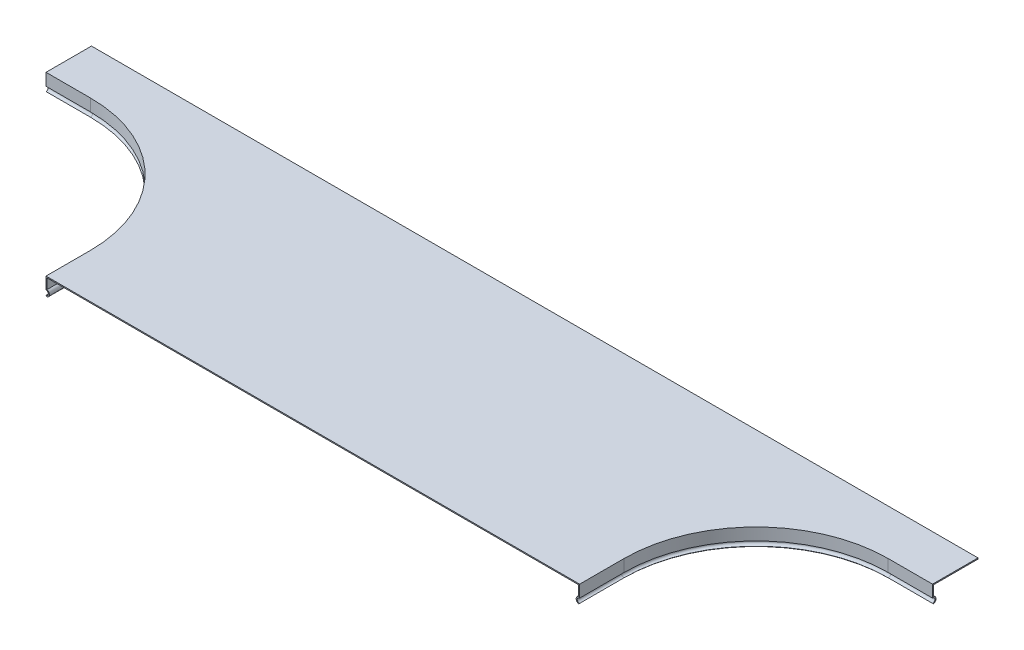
from build123d import *

# Parameters (mm, degrees)
EXTRUDE1_DEPTH      = 1.214
EXTRUDE5_DEPTH      = 943.578581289
EXTRUDE5_DEPTH_BACK = 943.578581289


with BuildPart() as part:
    # Sweep1: sweep along a path in Sketch1
    with BuildLine(Plane(origin=(0, 0, 0), x_dir=(1, 0, 0), z_dir=(0, 1, 0))) as sweep1_path:
        Line((0, 0), (0, 50))
        ThreePointArc((0, 50), (43.933982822, 156.066017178), (150, 200))
        Line((150, 200), (200, 200))
    # Sketch2 → Sweep1 (sweep)
    with BuildSketch(Plane.XY):
        with BuildLine():
            Line((0, 0), (0, -11.362166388))
            ThreePointArc((0, -11.362166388), (-2.736761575, -15.058202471), (0.112331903, -18.668356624))
            Line((0.112331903, -18.668356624), (1.214, -17.566688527))
            ThreePointArc((1.214, -17.566688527), (-1.523208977, -15), (1.214, -12.433311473))
            Line((1.214, -12.433311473), (1.214, 1.214))
            Line((1.214, 1.214), (-298.786, 1.214))
            Line((-298.786, 1.214), (-298.786, 0))
            Line((-298.786, 0), (0, 0))
        make_face()
    sweep(path=sweep1_path.line)

    # Sweep2: sweep along a path in Sketch3
    with BuildLine(Plane(origin=(0, 0, 0), x_dir=(1, 0, 0), z_dir=(0, 1, 0))) as sweep2_path:
        Line((-798.786, 200), (-748.786, 200))
        ThreePointArc((-748.786, 200), (-642.719982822, 156.066017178), (-598.786, 50))
        Line((-598.786, 50), (-598.786, 0))
    # Sketch4 → Sweep2 (sweep)
    with BuildSketch(Plane.XY):
        with BuildLine():
            Line((-598.786, 0), (-598.786, -11.413915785))
            ThreePointArc((-598.786, -11.413915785), (-596.214838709, -15.079686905), (-598.938000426, -18.633999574))
            Line((-598.938000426, -18.633999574), (-600, -17.572))
            ThreePointArc((-600, -17.572), (-597.428, -15), (-600, -12.428))
            Line((-600, -12.428), (-600, 1.214))
            Line((-600, 1.214), (-298.786, 1.214))
            Line((-298.786, 1.214), (-298.786, 0))
            Line((-298.786, 0), (-598.786, 0))
        make_face()
    sweep(path=sweep2_path.line)

    # Sketch5 → Extrude1 (add)
    with BuildSketch(Plane(origin=(0, 1.214, 0), x_dir=(1, 0, 0), z_dir=(0, 1, 0))):
        Polygon((-798.393, 198.786), (-798.393, 250), (199.607, 250), (199.607, 198.786), (-254.393, 198.786), (-254.393, 48.786), (-299.393, 48.786), (-344.393, 48.786), (-344.393, 198.786), align=None)
    extrude(amount=-EXTRUDE1_DEPTH)

    # Sketch10 → Extrude5 (cut, two sides: drawn at the far end of the back side and taken through both)
    with BuildSketch(Plane(origin=(0, 1.214, 0), x_dir=(1, 0, 0), z_dir=(0, 1, 0)).offset(-EXTRUDE5_DEPTH_BACK)):
        with BuildLine():
            Line((-798.786, 250), (-345.673112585, 250))
            ThreePointArc((-345.673112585, 250), (-511.615175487, 432.426463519), (-748.786, 500))
            Line((-748.786, 500), (-798.786, 500))
            Line((-798.786, 500), (-798.786, 250))
        make_face()
        with BuildLine():
            ThreePointArc((150, 498.786), (-86.274918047, 431.553452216), (-251.757232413, 250))
            Line((-251.757232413, 250), (200, 250))
            Line((200, 250), (200, 498.786))
            Line((200, 498.786), (150, 498.786))
        make_face()
    extrude(amount=EXTRUDE5_DEPTH + EXTRUDE5_DEPTH_BACK, mode=Mode.SUBTRACT)


solid = part.part
